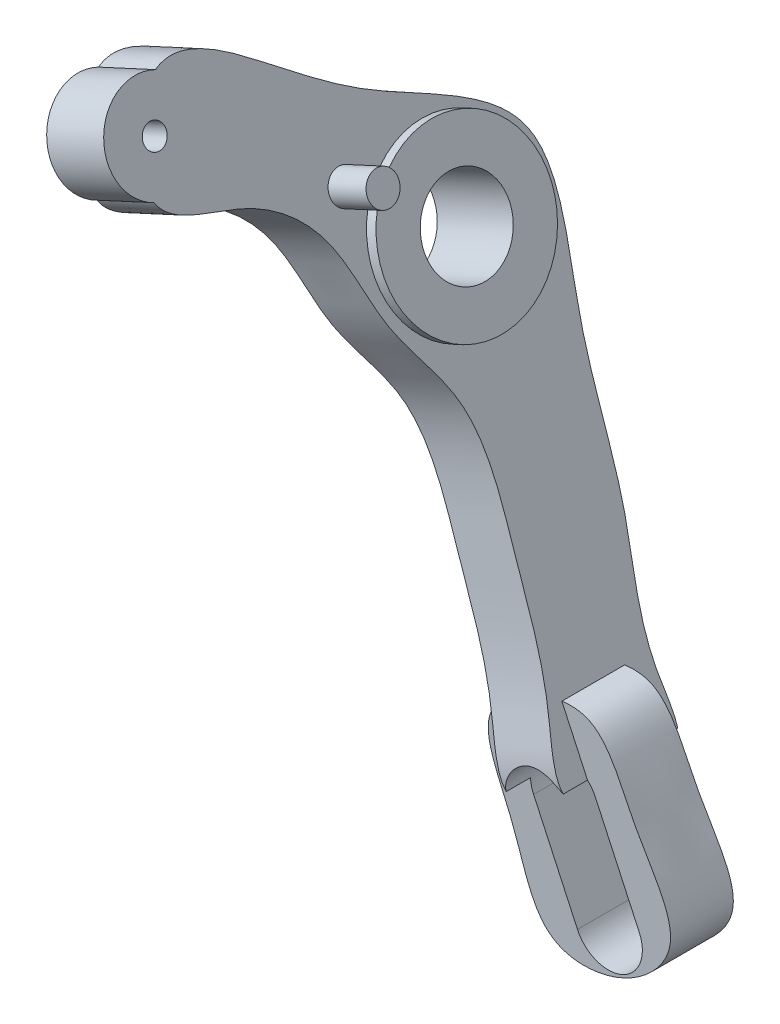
ISO-10303-21;
HEADER;
FILE_DESCRIPTION(('STEP AP214'),'2;1');
FILE_NAME('part.step','',(''),(''),'','','');
FILE_SCHEMA(('AUTOMOTIVE_DESIGN { 1 0 10303 214 1 1 1 1 }'));
ENDSEC;
DATA;
#1=APPLICATION_CONTEXT('core data for automotive mechanical design processes');
#2=APPLICATION_PROTOCOL_DEFINITION('international standard','automotive_design',2000,#1);
#3=PRODUCT_CONTEXT('',#1,'mechanical');
#4=PRODUCT('Part','Part','',(#3));
#5=PRODUCT_RELATED_PRODUCT_CATEGORY('part','',(#4));
#6=PRODUCT_DEFINITION_FORMATION('','',#4);
#7=PRODUCT_DEFINITION_CONTEXT('part definition',#1,'design');
#8=PRODUCT_DEFINITION('design','',#6,#7);
#9=PRODUCT_DEFINITION_SHAPE('','',#8);
#10=(LENGTH_UNIT() NAMED_UNIT(*) SI_UNIT(.MILLI.,.METRE.));
#11=(NAMED_UNIT(*) PLANE_ANGLE_UNIT() SI_UNIT($,.RADIAN.));
#12=(NAMED_UNIT(*) SI_UNIT($,.STERADIAN.) SOLID_ANGLE_UNIT());
#13=UNCERTAINTY_MEASURE_WITH_UNIT(LENGTH_MEASURE(1.E-05),#10,'distance_accuracy_value','');
#14=(GEOMETRIC_REPRESENTATION_CONTEXT(3) GLOBAL_UNCERTAINTY_ASSIGNED_CONTEXT((#13)) GLOBAL_UNIT_ASSIGNED_CONTEXT((#10,
#11,#12)) REPRESENTATION_CONTEXT('',''));
#15=CARTESIAN_POINT('',(0.,0.,0.));
#16=DIRECTION('',(0.,0.,1.));
#17=DIRECTION('',(1.,0.,0.));
#18=AXIS2_PLACEMENT_3D('',#15,#16,#17);
#19=CARTESIAN_POINT('',(430.319695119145,396.95551146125,-2.19631524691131));
#20=CARTESIAN_POINT('',(431.22681605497,394.990082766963,-3.15876795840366));
#21=CARTESIAN_POINT('',(431.517097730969,394.361139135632,-10.0566333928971));
#22=CARTESIAN_POINT('',(433.867436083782,389.268739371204,-16.0302949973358));
#23=CARTESIAN_POINT('',(437.242700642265,381.955666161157,-17.2201584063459));
#24=CARTESIAN_POINT('',(440.412269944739,375.088266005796,-23.2873268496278));
#25=CARTESIAN_POINT('',(445.123729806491,364.880102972,-21.8534182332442));
#26=CARTESIAN_POINT('',(448.883192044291,356.734601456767,-21.5246217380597));
#27=CARTESIAN_POINT('',(453.24164815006,347.291279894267,-17.578999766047));
#28=CARTESIAN_POINT('',(453.755843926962,346.177189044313,-31.9172258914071));
#29=CARTESIAN_POINT('',(449.228371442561,355.986712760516,-29.6405225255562));
#30=CARTESIAN_POINT('',(445.242127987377,364.623573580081,-32.7660924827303));
#31=CARTESIAN_POINT('',(439.926896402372,376.139908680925,-32.6259652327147));
#32=CARTESIAN_POINT('',(433.205878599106,390.702113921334,-37.7907879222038));
#33=CARTESIAN_POINT('',(431.054469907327,395.36349942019,-22.8994543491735));
#34=CARTESIAN_POINT('',(428.478191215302,400.945436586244,-15.3559389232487));
#35=CARTESIAN_POINT('',(425.343811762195,407.736592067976,-5.34947256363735));
#36=CARTESIAN_POINT('',(429.312632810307,399.137479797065,-1.12782502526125));
#37=CARTESIAN_POINT('',(430.319695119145,396.95551146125,-2.19631524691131));
#38=B_SPLINE_CURVE_WITH_KNOTS('',3,(#19,#20,#21,#22,#23,#24,#25,#26,#27,#28,#29,#30,#31,#32,#33,
#34,#35,#36,#37),.UNSPECIFIED.,.T.,.F.,(4,1,1,1,1,1,1,1,1,1,1,1,1,1,1,1,4),(0.,
0.0512804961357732,0.100877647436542,0.149980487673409,0.199406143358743,0.277465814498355,
0.346617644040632,0.385776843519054,0.449032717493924,0.48604368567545,0.557342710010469,
0.644342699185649,0.733550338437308,0.820503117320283,0.883725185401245,0.943069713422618,1.),.UNSPECIFIED.);
#39=DIRECTION('',(0.907959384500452,0.419058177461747,0.));
#40=VECTOR('',#39,1.);
#41=SURFACE_OF_LINEAR_EXTRUSION('',#38,#40);
#42=CARTESIAN_POINT('',(435.767451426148,399.46986052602,-2.19631524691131));
#43=CARTESIAN_POINT('',(436.674572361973,397.504431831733,-3.15876795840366));
#44=CARTESIAN_POINT('',(436.964854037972,396.875488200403,-10.0566333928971));
#45=CARTESIAN_POINT('',(439.315192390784,391.783088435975,-16.0302949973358));
#46=CARTESIAN_POINT('',(442.690456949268,384.470015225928,-17.2201584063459));
#47=CARTESIAN_POINT('',(445.860026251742,377.602615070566,-23.2873268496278));
#48=CARTESIAN_POINT('',(450.571486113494,367.39445203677,-21.8534182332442));
#49=CARTESIAN_POINT('',(454.330948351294,359.248950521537,-21.5246217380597));
#50=CARTESIAN_POINT('',(458.689404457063,349.805628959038,-17.578999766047));
#51=CARTESIAN_POINT('',(459.203600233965,348.691538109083,-31.9172258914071));
#52=CARTESIAN_POINT('',(454.676127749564,358.501061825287,-29.6405225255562));
#53=CARTESIAN_POINT('',(450.68988429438,367.137922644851,-32.7660924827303));
#54=CARTESIAN_POINT('',(445.374652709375,378.654257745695,-32.6259652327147));
#55=CARTESIAN_POINT('',(438.653634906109,393.216462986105,-37.7907879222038));
#56=CARTESIAN_POINT('',(436.502226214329,397.877848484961,-22.8994543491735));
#57=CARTESIAN_POINT('',(433.925947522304,403.459785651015,-15.3559389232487));
#58=CARTESIAN_POINT('',(430.791568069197,410.250941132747,-5.34947256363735));
#59=CARTESIAN_POINT('',(434.76038911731,401.651828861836,-1.12782502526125));
#60=CARTESIAN_POINT('',(435.767451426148,399.46986052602,-2.19631524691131));
#61=B_SPLINE_CURVE_WITH_KNOTS('',3,(#42,#43,#44,#45,#46,#47,#48,#49,#50,#51,#52,#53,#54,#55,#56,
#57,#58,#59,#60),.UNSPECIFIED.,.T.,.F.,(4,1,1,1,1,1,1,1,1,1,1,1,1,1,1,1,4),(0.,
0.0512804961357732,0.100877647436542,0.149980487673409,0.199406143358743,0.277465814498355,
0.346617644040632,0.385776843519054,0.449032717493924,0.48604368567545,0.557342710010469,
0.644342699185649,0.733550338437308,0.820503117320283,0.883725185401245,0.943069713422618,1.),.UNSPECIFIED.);
#62=CARTESIAN_POINT('',(435.767451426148,399.46986052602,-2.19631524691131));
#63=VERTEX_POINT('',#62);
#64=CARTESIAN_POINT('',(457.402290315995,352.594376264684,-19.6780583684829));
#65=VERTEX_POINT('',#64);
#66=EDGE_CURVE('E289',#63,#65,#61,.T.);
#67=ORIENTED_EDGE('',*,*,#66,.F.);
#68=DIRECTION('',(0.907959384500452,0.419058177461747,0.));
#69=VECTOR('',#68,1.);
#70=CARTESIAN_POINT('',(430.319695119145,396.95551146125,-2.19631524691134));
#71=LINE('',#70,#69);
#72=CARTESIAN_POINT('',(430.319695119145,396.95551146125,-2.19631524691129));
#73=VERTEX_POINT('',#72);
#74=EDGE_CURVE('E292',#73,#63,#71,.T.);
#75=ORIENTED_EDGE('',*,*,#74,.F.);
#76=CARTESIAN_POINT('',(451.954534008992,350.080027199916,-19.6780583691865));
#77=VERTEX_POINT('',#76);
#78=EDGE_CURVE('E297',#73,#77,#38,.T.);
#79=ORIENTED_EDGE('',*,*,#78,.T.);
#80=CARTESIAN_POINT('',(457.402290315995,352.594376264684,-19.6780583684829));
#81=CARTESIAN_POINT('',(457.342995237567,352.648947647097,-19.6605359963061));
#82=CARTESIAN_POINT('',(457.281210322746,352.701663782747,-19.6459470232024));
#83=CARTESIAN_POINT('',(457.153344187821,352.802686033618,-19.6217790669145));
#84=CARTESIAN_POINT('',(457.087268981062,352.850998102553,-19.6121932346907));
#85=CARTESIAN_POINT('',(456.951718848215,352.942410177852,-19.5971734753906));
#86=CARTESIAN_POINT('',(456.882264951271,352.985537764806,-19.5917166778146));
#87=CARTESIAN_POINT('',(456.740168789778,353.066507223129,-19.584046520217));
#88=CARTESIAN_POINT('',(456.66752547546,353.10434733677,-19.581834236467));
#89=CARTESIAN_POINT('',(456.446304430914,353.209123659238,-19.5789311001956));
#90=CARTESIAN_POINT('',(456.293680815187,353.267824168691,-19.5819087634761));
#91=CARTESIAN_POINT('',(455.981432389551,353.361686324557,-19.5927946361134));
#92=CARTESIAN_POINT('',(455.821797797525,353.396813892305,-19.600709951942));
#93=CARTESIAN_POINT('',(455.484118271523,353.444897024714,-19.6186692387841));
#94=CARTESIAN_POINT('',(455.305739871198,353.455491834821,-19.6288425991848));
#95=CARTESIAN_POINT('',(454.949499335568,353.447299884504,-19.6474770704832));
#96=CARTESIAN_POINT('',(454.771637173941,353.428514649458,-19.6559382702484));
#97=CARTESIAN_POINT('',(454.50673804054,353.378284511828,-19.6659034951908));
#98=CARTESIAN_POINT('',(454.417619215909,353.357447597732,-19.6687894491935));
#99=CARTESIAN_POINT('',(454.2414365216,353.308329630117,-19.6734229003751));
#100=CARTESIAN_POINT('',(454.154371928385,353.280051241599,-19.6751708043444));
#101=CARTESIAN_POINT('',(453.982900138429,353.216236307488,-19.6774277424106));
#102=CARTESIAN_POINT('',(453.898493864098,353.180697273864,-19.6779363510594));
#103=CARTESIAN_POINT('',(453.733012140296,353.102640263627,-19.6776871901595));
#104=CARTESIAN_POINT('',(453.651935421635,353.060124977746,-19.6769299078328));
#105=CARTESIAN_POINT('',(453.494637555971,352.968978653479,-19.6742076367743));
#106=CARTESIAN_POINT('',(453.418369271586,352.920428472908,-19.6722574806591));
#107=CARTESIAN_POINT('',(453.270191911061,352.817182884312,-19.6672700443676));
#108=CARTESIAN_POINT('',(453.198281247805,352.762489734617,-19.6642331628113));
#109=CARTESIAN_POINT('',(453.0592681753,352.647317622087,-19.6572454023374));
#110=CARTESIAN_POINT('',(452.992167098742,352.586837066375,-19.6532942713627));
#111=CARTESIAN_POINT('',(452.863274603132,352.460548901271,-19.6447252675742));
#112=CARTESIAN_POINT('',(452.801481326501,352.394743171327,-19.640107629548));
#113=CARTESIAN_POINT('',(452.683255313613,352.257846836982,-19.6304973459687));
#114=CARTESIAN_POINT('',(452.626855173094,352.186728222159,-19.6255027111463));
#115=CARTESIAN_POINT('',(452.520216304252,352.040048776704,-19.615572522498));
#116=CARTESIAN_POINT('',(452.469975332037,351.964489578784,-19.6106369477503));
#117=CARTESIAN_POINT('',(452.375896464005,351.809286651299,-19.6013161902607));
#118=CARTESIAN_POINT('',(452.332068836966,351.729636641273,-19.5969318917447));
#119=CARTESIAN_POINT('',(452.251235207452,351.566931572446,-19.5893312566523));
#120=CARTESIAN_POINT('',(452.214226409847,351.483877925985,-19.5861144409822));
#121=CARTESIAN_POINT('',(452.147008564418,351.314225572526,-19.5815502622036));
#122=CARTESIAN_POINT('',(452.116857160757,351.227603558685,-19.5802182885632));
#123=CARTESIAN_POINT('',(452.063974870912,351.052090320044,-19.5803460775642));
#124=CARTESIAN_POINT('',(452.041245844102,350.963198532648,-19.5818065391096));
#125=CARTESIAN_POINT('',(452.003471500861,350.784269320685,-19.5885188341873));
#126=CARTESIAN_POINT('',(451.988398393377,350.694237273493,-19.5937567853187));
#127=CARTESIAN_POINT('',(451.965914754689,350.513685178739,-19.609129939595));
#128=CARTESIAN_POINT('',(451.958496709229,350.423165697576,-19.6192603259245));
#129=CARTESIAN_POINT('',(451.953157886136,350.290582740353,-19.638610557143));
#130=CARTESIAN_POINT('',(451.952287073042,350.248270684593,-19.6454660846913));
#131=CARTESIAN_POINT('',(451.952187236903,350.163917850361,-19.6606369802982));
#132=CARTESIAN_POINT('',(451.952957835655,350.121877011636,-19.6689520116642));
#133=CARTESIAN_POINT('',(451.954534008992,350.080027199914,-19.6780583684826));
#134=B_SPLINE_CURVE_WITH_KNOTS('',3,(#80,#81,#82,#83,#84,#85,#86,#87,#88,#89,#90,#91,#92,#93,
#94,#95,#96,#97,#98,#99,#100,#101,#102,#103,#104,#105,#106,#107,#108,#109,#110,#111,#112,#113,
#114,#115,#116,#117,#118,#119,#120,#121,#122,#123,#124,#125,#126,#127,#128,#129,#130,#131,#132,
#133),.UNSPECIFIED.,.F.,.F.,(4,2,2,2,2,2,2,2,2,2,2,2,2,2,2,2,2,2,2,2,2,2,2,2,2,2,4),(0.,
0.2472072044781,0.49407510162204,0.739565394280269,0.985137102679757,1.47357669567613,
1.96272089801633,2.49726926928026,3.0317898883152,3.30621563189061,3.58054322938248,
3.85496498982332,4.12928115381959,4.40025381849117,4.67112718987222,4.94207532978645,
5.21292825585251,5.48532651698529,5.75762524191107,6.03035529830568,6.30297330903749,
6.57780461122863,6.85270470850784,7.12659965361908,7.40022548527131,7.52879402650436,
7.65733294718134),.UNSPECIFIED.);
#135=EDGE_CURVE('E185',#65,#77,#134,.T.);
#136=ORIENTED_EDGE('',*,*,#135,.F.);
#137=EDGE_LOOP('',(#67,#75,#79,#136));
#138=FACE_BOUND('',#137,.T.);
#139=ADVANCED_FACE('F67',(#138),#41,.T.);
#140=CARTESIAN_POINT('',(451.954534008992,350.080027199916,-30.625687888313));
#141=VERTEX_POINT('',#140);
#142=CARTESIAN_POINT('',(426.864386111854,404.44201431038,-5.80368475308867));
#143=VERTEX_POINT('',#142);
#144=EDGE_CURVE('E293',#141,#143,#38,.T.);
#145=ORIENTED_EDGE('',*,*,#144,.T.);
#146=DIRECTION('',(0.907959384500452,0.419058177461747,0.));
#147=VECTOR('',#146,1.);
#148=CARTESIAN_POINT('',(426.864386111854,404.44201431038,-5.80368475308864));
#149=LINE('',#148,#147);
#150=CARTESIAN_POINT('',(432.312142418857,406.95636337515,-5.80368475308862));
#151=VERTEX_POINT('',#150);
#152=EDGE_CURVE('E359',#151,#143,#149,.F.);
#153=ORIENTED_EDGE('',*,*,#152,.F.);
#154=CARTESIAN_POINT('',(457.402290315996,352.594376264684,-30.6256878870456));
#155=VERTEX_POINT('',#154);
#156=EDGE_CURVE('E294',#155,#151,#61,.T.);
#157=ORIENTED_EDGE('',*,*,#156,.F.);
#158=CARTESIAN_POINT('',(451.954534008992,350.080027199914,-30.6256878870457));
#159=CARTESIAN_POINT('',(451.951215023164,350.167768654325,-30.6362105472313));
#160=CARTESIAN_POINT('',(451.951477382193,350.25584929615,-30.6447610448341));
#161=CARTESIAN_POINT('',(451.959166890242,350.431905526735,-30.6586447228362));
#162=CARTESIAN_POINT('',(451.966589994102,350.51988114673,-30.6639797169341));
#163=CARTESIAN_POINT('',(451.988575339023,350.694853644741,-30.6721606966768));
#164=CARTESIAN_POINT('',(452.003121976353,350.781852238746,-30.6750120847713));
#165=CARTESIAN_POINT('',(452.039238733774,350.95440661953,-30.6788448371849));
#166=CARTESIAN_POINT('',(452.060809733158,351.039962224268,-30.6798259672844));
#167=CARTESIAN_POINT('',(452.135793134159,351.293281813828,-30.6807603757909));
#168=CARTESIAN_POINT('',(452.199529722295,351.458123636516,-30.6787190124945));
#169=CARTESIAN_POINT('',(452.352797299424,351.775237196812,-30.6724526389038));
#170=CARTESIAN_POINT('',(452.442336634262,351.927504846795,-30.6682269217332));
#171=CARTESIAN_POINT('',(452.648254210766,352.220357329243,-30.6594904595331));
#172=CARTESIAN_POINT('',(452.765423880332,352.360387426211,-30.6549749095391));
#173=CARTESIAN_POINT('',(453.021547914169,352.618908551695,-30.6471625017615));
#174=CARTESIAN_POINT('',(453.160504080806,352.737397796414,-30.6438657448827));
#175=CARTESIAN_POINT('',(453.456874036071,352.949903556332,-30.6391942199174));
#176=CARTESIAN_POINT('',(453.614357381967,353.043823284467,-30.6378269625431));
#177=CARTESIAN_POINT('',(453.942856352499,353.203894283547,-30.6372873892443));
#178=CARTESIAN_POINT('',(454.11387198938,353.27004552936,-30.6381150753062));
#179=CARTESIAN_POINT('',(454.464192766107,353.37258779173,-30.6418147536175));
#180=CARTESIAN_POINT('',(454.643479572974,353.409041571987,-30.6446824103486));
#181=CARTESIAN_POINT('',(455.005560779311,353.451416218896,-30.651867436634));
#182=CARTESIAN_POINT('',(455.188355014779,353.45733850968,-30.65618473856));
#183=CARTESIAN_POINT('',(455.552764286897,353.438442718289,-30.6651009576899));
#184=CARTESIAN_POINT('',(455.734376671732,353.413570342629,-30.6697003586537));
#185=CARTESIAN_POINT('',(456.001592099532,353.353744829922,-30.6752390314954));
#186=CARTESIAN_POINT('',(456.08983974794,353.33003258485,-30.676858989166));
#187=CARTESIAN_POINT('',(456.264028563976,353.275266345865,-30.6792698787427));
#188=CARTESIAN_POINT('',(456.349970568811,353.244215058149,-30.6800611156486));
#189=CARTESIAN_POINT('',(456.52337446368,353.173165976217,-30.6803826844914));
#190=CARTESIAN_POINT('',(456.610679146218,353.132783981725,-30.6798446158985));
#191=CARTESIAN_POINT('',(456.781335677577,353.044465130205,-30.6767287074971));
#192=CARTESIAN_POINT('',(456.864687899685,352.996528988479,-30.6741510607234));
#193=CARTESIAN_POINT('',(457.026953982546,352.893377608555,-30.6661935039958));
#194=CARTESIAN_POINT('',(457.105855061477,352.838142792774,-30.6608059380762));
#195=CARTESIAN_POINT('',(457.258294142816,352.721062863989,-30.6462888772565));
#196=CARTESIAN_POINT('',(457.331828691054,352.659213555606,-30.6371569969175));
#197=CARTESIAN_POINT('',(457.402290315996,352.594376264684,-30.6256878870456));
#198=B_SPLINE_CURVE_WITH_KNOTS('',3,(#158,#159,#160,#161,#162,#163,#164,#165,#166,#167,#168,
#169,#170,#171,#172,#173,#174,#175,#176,#177,#178,#179,#180,#181,#182,#183,#184,#185,#186,#187,
#188,#189,#190,#191,#192,#193,#194,#195,#196,#197),.UNSPECIFIED.,.F.,.F.,(4,2,2,2,2,2,2,2,2,2,2,
2,2,2,2,2,2,2,2,4),(0.,0.265155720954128,0.530161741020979,0.794589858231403,1.05905108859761,
1.58670323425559,2.11452623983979,2.6598494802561,3.20521785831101,3.75270331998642,
4.30018927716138,4.84651513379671,5.39281550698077,5.94008042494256,6.21398827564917,
6.48779528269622,6.77598167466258,7.06414079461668,7.35308917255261,7.64222192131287),.UNSPECIFIED.);
#199=EDGE_CURVE('E207',#141,#155,#198,.T.);
#200=ORIENTED_EDGE('',*,*,#199,.F.);
#201=EDGE_LOOP('',(#145,#153,#157,#200));
#202=FACE_BOUND('',#201,.T.);
#203=ADVANCED_FACE('F69',(#202),#41,.T.);
#204=CARTESIAN_POINT('',(449.219383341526,356.006186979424,-30.4725989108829));
#205=DIRECTION('',(0.907959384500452,0.419058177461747,0.));
#206=DIRECTION('',(-0.419058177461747,0.907959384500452,0.));
#207=AXIS2_PLACEMENT_3D('',#204,#205,#206);
#208=PLANE('',#207);
#209=CARTESIAN_POINT('',(428.5920406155,400.698762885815,-4.));
#210=DIRECTION('',(-0.907959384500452,-0.419058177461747,0.));
#211=DIRECTION('',(-0.419058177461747,0.907959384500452,0.));
#212=AXIS2_PLACEMENT_3D('',#209,#210,#211);
#213=CIRCLE('',#212,1.1);
#214=CARTESIAN_POINT('',(428.131076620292,401.697518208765,-4.));
#215=VERTEX_POINT('',#214);
#216=EDGE_CURVE('E215',#215,#215,#213,.T.);
#217=ORIENTED_EDGE('',*,*,#216,.F.);
#218=EDGE_LOOP('',(#217));
#219=FACE_BOUND('',#218,.T.);
#220=CARTESIAN_POINT('',(435.506500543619,385.717433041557,-26.));
#221=DIRECTION('',(-0.907959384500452,-0.419058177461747,0.));
#222=DIRECTION('',(-0.419058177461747,0.907959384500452,0.));
#223=AXIS2_PLACEMENT_3D('',#220,#221,#222);
#224=CIRCLE('',#223,8.);
#225=CARTESIAN_POINT('',(432.154035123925,392.981108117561,-26.));
#226=VERTEX_POINT('',#225);
#227=EDGE_CURVE('E299',#226,#226,#224,.T.);
#228=ORIENTED_EDGE('',*,*,#227,.F.);
#229=EDGE_LOOP('',(#228));
#230=FACE_BOUND('',#229,.T.);
#231=ORIENTED_EDGE('',*,*,#78,.F.);
#232=CARTESIAN_POINT('',(428.5920406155,400.698762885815,-4.));
#233=DIRECTION('',(-0.907959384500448,-0.419058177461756,0.));
#234=DIRECTION('',(-0.419058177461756,0.907959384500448,0.));
#235=AXIS2_PLACEMENT_3D('',#232,#233,#234);
#236=CIRCLE('',#235,4.5);
#237=EDGE_CURVE('E361',#73,#143,#236,.T.);
#238=ORIENTED_EDGE('',*,*,#237,.T.);
#239=ORIENTED_EDGE('',*,*,#144,.F.);
#240=DIRECTION('',(0.,0.,-1.));
#241=VECTOR('',#240,1.);
#242=CARTESIAN_POINT('',(451.954534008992,350.080027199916,0.500000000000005));
#243=LINE('',#242,#241);
#244=CARTESIAN_POINT('',(451.954534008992,350.080027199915,-28.));
#245=VERTEX_POINT('',#244);
#246=EDGE_CURVE('E186',#245,#141,#243,.T.);
#247=ORIENTED_EDGE('',*,*,#246,.F.);
#248=DIRECTION('',(0.419058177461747,-0.907959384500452,0.));
#249=VECTOR('',#248,1.);
#250=CARTESIAN_POINT('',(449.219383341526,356.006186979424,-28.));
#251=LINE('',#250,#249);
#252=CARTESIAN_POINT('',(449.503668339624,355.390236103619,-28.));
#253=VERTEX_POINT('',#252);
#254=EDGE_CURVE('E351',#253,#245,#251,.T.);
#255=ORIENTED_EDGE('',*,*,#254,.F.);
#256=DIRECTION('',(0.,0.,1.));
#257=VECTOR('',#256,1.);
#258=CARTESIAN_POINT('',(449.50366835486,355.390236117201,-28.));
#259=LINE('',#258,#257);
#260=CARTESIAN_POINT('',(449.503668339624,355.390236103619,-22.));
#261=VERTEX_POINT('',#260);
#262=EDGE_CURVE('E349',#253,#261,#259,.T.);
#263=ORIENTED_EDGE('',*,*,#262,.T.);
#264=DIRECTION('',(0.419058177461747,-0.907959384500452,0.));
#265=VECTOR('',#264,1.);
#266=CARTESIAN_POINT('',(449.219383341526,356.006186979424,-22.));
#267=LINE('',#266,#265);
#268=CARTESIAN_POINT('',(451.954534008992,350.080027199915,-22.));
#269=VERTEX_POINT('',#268);
#270=EDGE_CURVE('E229',#261,#269,#267,.T.);
#271=ORIENTED_EDGE('',*,*,#270,.T.);
#272=EDGE_CURVE('E182',#77,#269,#243,.T.);
#273=ORIENTED_EDGE('',*,*,#272,.F.);
#274=EDGE_LOOP('',(#231,#238,#239,#247,#255,#263,#271,#273));
#275=FACE_BOUND('',#274,.T.);
#276=ADVANCED_FACE('F270',(#219,#230,#275),#208,.F.);
#277=CARTESIAN_POINT('',(454.667139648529,358.520536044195,-30.4725989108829));
#278=DIRECTION('',(0.907959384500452,0.419058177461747,0.));
#279=DIRECTION('',(-0.419058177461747,0.907959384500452,0.));
#280=AXIS2_PLACEMENT_3D('',#277,#278,#279);
#281=PLANE('',#280);
#282=DIRECTION('',(0.,0.,-1.));
#283=VECTOR('',#282,1.);
#284=CARTESIAN_POINT('',(457.402290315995,352.594376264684,0.499999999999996));
#285=LINE('',#284,#283);
#286=CARTESIAN_POINT('',(457.402290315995,352.594376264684,-21.999999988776));
#287=VERTEX_POINT('',#286);
#288=EDGE_CURVE('E194',#65,#287,#285,.T.);
#289=ORIENTED_EDGE('',*,*,#288,.T.);
#290=DIRECTION('',(0.419058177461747,-0.907959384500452,0.));
#291=VECTOR('',#290,1.);
#292=CARTESIAN_POINT('',(454.667139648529,358.520536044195,-22.));
#293=LINE('',#292,#291);
#294=CARTESIAN_POINT('',(454.951424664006,357.904585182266,-22.));
#295=VERTEX_POINT('',#294);
#296=EDGE_CURVE('E316',#295,#287,#293,.T.);
#297=ORIENTED_EDGE('',*,*,#296,.F.);
#298=DIRECTION('',(0.,0.,1.));
#299=VECTOR('',#298,1.);
#300=CARTESIAN_POINT('',(454.951424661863,357.904585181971,-28.));
#301=LINE('',#300,#299);
#302=CARTESIAN_POINT('',(454.951424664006,357.904585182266,-28.));
#303=VERTEX_POINT('',#302);
#304=EDGE_CURVE('E319',#303,#295,#301,.T.);
#305=ORIENTED_EDGE('',*,*,#304,.F.);
#306=DIRECTION('',(0.419058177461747,-0.907959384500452,0.));
#307=VECTOR('',#306,1.);
#308=CARTESIAN_POINT('',(454.667139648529,358.520536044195,-28.));
#309=LINE('',#308,#307);
#310=CARTESIAN_POINT('',(457.402290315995,352.594376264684,-28.000000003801));
#311=VERTEX_POINT('',#310);
#312=EDGE_CURVE('E322',#303,#311,#309,.T.);
#313=ORIENTED_EDGE('',*,*,#312,.T.);
#314=EDGE_CURVE('E214',#311,#155,#285,.T.);
#315=ORIENTED_EDGE('',*,*,#314,.T.);
#316=ORIENTED_EDGE('',*,*,#156,.T.);
#317=CARTESIAN_POINT('',(434.039796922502,403.213111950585,-4.));
#318=DIRECTION('',(-0.907959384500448,-0.419058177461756,0.));
#319=DIRECTION('',(-0.419058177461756,0.907959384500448,0.));
#320=AXIS2_PLACEMENT_3D('',#317,#318,#319);
#321=CIRCLE('',#320,4.5);
#322=EDGE_CURVE('E360',#63,#151,#321,.T.);
#323=ORIENTED_EDGE('',*,*,#322,.F.);
#324=ORIENTED_EDGE('',*,*,#66,.T.);
#325=EDGE_LOOP('',(#289,#297,#305,#313,#315,#316,#323,#324));
#326=FACE_BOUND('',#325,.T.);
#327=CARTESIAN_POINT('',(434.039796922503,403.213111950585,-4.));
#328=DIRECTION('',(-0.907959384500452,-0.419058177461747,0.));
#329=DIRECTION('',(-0.419058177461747,0.907959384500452,0.));
#330=AXIS2_PLACEMENT_3D('',#327,#328,#329);
#331=CIRCLE('',#330,1.1);
#332=CARTESIAN_POINT('',(433.578832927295,404.211867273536,-4.));
#333=VERTEX_POINT('',#332);
#334=EDGE_CURVE('E219',#333,#333,#331,.T.);
#335=ORIENTED_EDGE('',*,*,#334,.T.);
#336=EDGE_LOOP('',(#335));
#337=FACE_BOUND('',#336,.T.);
#338=CARTESIAN_POINT('',(438.23037869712,394.133518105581,-18.));
#339=DIRECTION('',(-0.907959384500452,-0.419058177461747,0.));
#340=DIRECTION('',(-0.419058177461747,0.907959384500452,0.));
#341=AXIS2_PLACEMENT_3D('',#338,#339,#340);
#342=CIRCLE('',#341,1.5);
#343=CARTESIAN_POINT('',(437.601791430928,395.495457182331,-18.));
#344=VERTEX_POINT('',#343);
#345=EDGE_CURVE('E313',#344,#344,#342,.T.);
#346=ORIENTED_EDGE('',*,*,#345,.T.);
#347=EDGE_LOOP('',(#346));
#348=FACE_BOUND('',#347,.T.);
#349=CARTESIAN_POINT('',(440.954256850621,388.231782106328,-26.));
#350=DIRECTION('',(-0.907959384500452,-0.419058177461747,0.));
#351=DIRECTION('',(-0.419058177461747,0.907959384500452,0.));
#352=AXIS2_PLACEMENT_3D('',#349,#350,#351);
#353=CIRCLE('',#352,8.);
#354=CARTESIAN_POINT('',(437.601791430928,395.495457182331,-26.));
#355=VERTEX_POINT('',#354);
#356=EDGE_CURVE('E307',#355,#355,#353,.T.);
#357=ORIENTED_EDGE('',*,*,#356,.T.);
#358=EDGE_LOOP('',(#357));
#359=FACE_BOUND('',#358,.T.);
#360=ADVANCED_FACE('F265',(#326,#337,#348,#359),#281,.T.);
#361=CARTESIAN_POINT('',(441.862216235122,388.650840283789,-26.));
#362=DIRECTION('',(0.907959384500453,0.419058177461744,0.));
#363=DIRECTION('',(-0.419058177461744,0.907959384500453,0.));
#364=AXIS2_PLACEMENT_3D('',#361,#362,#363);
#365=PLANE('',#364);
#366=CARTESIAN_POINT('',(441.862216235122,388.650840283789,-26.));
#367=DIRECTION('',(-0.907959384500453,-0.419058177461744,0.));
#368=DIRECTION('',(-0.419058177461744,0.907959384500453,0.));
#369=AXIS2_PLACEMENT_3D('',#366,#367,#368);
#370=CIRCLE('',#369,4.1);
#371=CARTESIAN_POINT('',(440.144077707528,392.373473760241,-26.));
#372=VERTEX_POINT('',#371);
#373=EDGE_CURVE('E220',#372,#372,#370,.T.);
#374=ORIENTED_EDGE('',*,*,#373,.T.);
#375=EDGE_LOOP('',(#374));
#376=FACE_BOUND('',#375,.T.);
#377=CARTESIAN_POINT('',(441.862216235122,388.650840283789,-26.));
#378=DIRECTION('',(-0.907959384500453,-0.419058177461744,0.));
#379=DIRECTION('',(-0.419058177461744,0.907959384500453,0.));
#380=AXIS2_PLACEMENT_3D('',#377,#378,#379);
#381=CIRCLE('',#380,8.);
#382=CARTESIAN_POINT('',(438.509750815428,395.914515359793,-26.));
#383=VERTEX_POINT('',#382);
#384=EDGE_CURVE('E370',#383,#383,#381,.T.);
#385=ORIENTED_EDGE('',*,*,#384,.F.);
#386=EDGE_LOOP('',(#385));
#387=FACE_BOUND('',#386,.T.);
#388=ADVANCED_FACE('F261',(#376,#387),#365,.T.);
#389=CARTESIAN_POINT('',(434.598541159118,385.298374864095,-26.));
#390=DIRECTION('',(0.907959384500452,0.419058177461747,0.));
#391=DIRECTION('',(-0.419058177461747,0.907959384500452,0.));
#392=AXIS2_PLACEMENT_3D('',#389,#390,#391);
#393=CYLINDRICAL_SURFACE('',#392,8.);
#394=ORIENTED_EDGE('',*,*,#356,.F.);
#395=EDGE_LOOP('',(#394));
#396=FACE_BOUND('',#395,.T.);
#397=ORIENTED_EDGE('',*,*,#384,.T.);
#398=EDGE_LOOP('',(#397));
#399=FACE_BOUND('',#398,.T.);
#400=ADVANCED_FACE('F257',(#396,#399),#393,.T.);
#401=CARTESIAN_POINT('',(434.598541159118,385.298374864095,-26.));
#402=DIRECTION('',(-0.907959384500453,-0.419058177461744,0.));
#403=DIRECTION('',(-0.419058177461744,0.907959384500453,0.));
#404=AXIS2_PLACEMENT_3D('',#401,#402,#403);
#405=CIRCLE('',#404,8.);
#406=CARTESIAN_POINT('',(431.246075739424,392.562049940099,-26.));
#407=VERTEX_POINT('',#406);
#408=EDGE_CURVE('E364',#407,#407,#405,.T.);
#409=ORIENTED_EDGE('',*,*,#408,.F.);
#410=EDGE_LOOP('',(#409));
#411=FACE_BOUND('',#410,.T.);
#412=ORIENTED_EDGE('',*,*,#227,.T.);
#413=EDGE_LOOP('',(#412));
#414=FACE_BOUND('',#413,.T.);
#415=ADVANCED_FACE('F260',(#411,#414),#393,.T.);
#416=CARTESIAN_POINT('',(434.598541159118,385.298374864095,-26.));
#417=DIRECTION('',(0.907959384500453,0.419058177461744,0.));
#418=DIRECTION('',(-0.419058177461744,0.907959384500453,0.));
#419=AXIS2_PLACEMENT_3D('',#416,#417,#418);
#420=PLANE('',#419);
#421=CARTESIAN_POINT('',(434.598541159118,385.298374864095,-26.));
#422=DIRECTION('',(-0.907959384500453,-0.419058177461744,0.));
#423=DIRECTION('',(-0.419058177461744,0.907959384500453,0.));
#424=AXIS2_PLACEMENT_3D('',#421,#422,#423);
#425=CIRCLE('',#424,4.1);
#426=CARTESIAN_POINT('',(432.880402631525,389.021008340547,-26.));
#427=VERTEX_POINT('',#426);
#428=EDGE_CURVE('E218',#427,#427,#425,.T.);
#429=ORIENTED_EDGE('',*,*,#428,.F.);
#430=EDGE_LOOP('',(#429));
#431=FACE_BOUND('',#430,.T.);
#432=ORIENTED_EDGE('',*,*,#408,.T.);
#433=EDGE_LOOP('',(#432));
#434=FACE_BOUND('',#433,.T.);
#435=ADVANCED_FACE('F255',(#431,#434),#420,.F.);
#436=CARTESIAN_POINT('',(428.5920406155,400.698762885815,-4.));
#437=DIRECTION('',(0.907959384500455,0.41905817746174,0.));
#438=DIRECTION('',(-0.41905817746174,0.907959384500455,0.));
#439=AXIS2_PLACEMENT_3D('',#436,#437,#438);
#440=CYLINDRICAL_SURFACE('',#439,4.5);
#441=ORIENTED_EDGE('',*,*,#152,.T.);
#442=ORIENTED_EDGE('',*,*,#237,.F.);
#443=ORIENTED_EDGE('',*,*,#74,.T.);
#444=ORIENTED_EDGE('',*,*,#322,.T.);
#445=EDGE_LOOP('',(#441,#442,#443,#444));
#446=FACE_BOUND('',#445,.T.);
#447=ADVANCED_FACE('F251',(#446),#440,.T.);
#448=CARTESIAN_POINT('',(441.862216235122,395.809750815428,-18.));
#449=DIRECTION('',(0.907959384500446,0.41905817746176,0.));
#450=DIRECTION('',(-0.41905817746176,0.907959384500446,0.));
#451=AXIS2_PLACEMENT_3D('',#448,#449,#450);
#452=PLANE('',#451);
#453=CARTESIAN_POINT('',(441.862216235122,395.809750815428,-18.));
#454=DIRECTION('',(-0.907959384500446,-0.41905817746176,0.));
#455=DIRECTION('',(-0.41905817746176,0.907959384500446,0.));
#456=AXIS2_PLACEMENT_3D('',#453,#454,#455);
#457=CIRCLE('',#456,1.5);
#458=CARTESIAN_POINT('',(441.233628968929,397.171689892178,-18.));
#459=VERTEX_POINT('',#458);
#460=EDGE_CURVE('E528',#459,#459,#457,.T.);
#461=ORIENTED_EDGE('',*,*,#460,.F.);
#462=EDGE_LOOP('',(#461));
#463=FACE_BOUND('',#462,.T.);
#464=ADVANCED_FACE('F247',(#463),#452,.T.);
#465=CARTESIAN_POINT('',(438.23037869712,394.133518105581,-18.));
#466=DIRECTION('',(0.90795938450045,0.41905817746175,0.));
#467=DIRECTION('',(-0.41905817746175,0.90795938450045,0.));
#468=AXIS2_PLACEMENT_3D('',#465,#466,#467);
#469=CYLINDRICAL_SURFACE('',#468,1.5);
#470=ORIENTED_EDGE('',*,*,#460,.T.);
#471=EDGE_LOOP('',(#470));
#472=FACE_BOUND('',#471,.T.);
#473=ORIENTED_EDGE('',*,*,#345,.F.);
#474=EDGE_LOOP('',(#473));
#475=FACE_BOUND('',#474,.T.);
#476=ADVANCED_FACE('F241',(#472,#475),#469,.T.);
#477=CARTESIAN_POINT('',(448.148088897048,353.554717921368,-28.));
#478=CARTESIAN_POINT('',(447.297042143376,351.329023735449,-28.));
#479=CARTESIAN_POINT('',(450.863948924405,345.531263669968,-28.));
#480=CARTESIAN_POINT('',(452.453990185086,336.529845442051,-28.));
#481=CARTESIAN_POINT('',(461.252405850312,337.093548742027,-28.));
#482=CARTESIAN_POINT('',(467.389610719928,343.423208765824,-28.));
#483=CARTESIAN_POINT('',(461.571338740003,350.473135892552,-28.));
#484=CARTESIAN_POINT('',(458.835109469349,358.919679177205,-28.));
#485=CARTESIAN_POINT('',(451.877982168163,357.404800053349,-28.));
#486=CARTESIAN_POINT('',(448.693901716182,354.982151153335,-28.));
#487=CARTESIAN_POINT('',(448.148088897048,353.554717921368,-28.));
#488=B_SPLINE_CURVE_WITH_KNOTS('',3,(#477,#478,#479,#480,#481,#482,#483,#484,#485,#486,#487),
.UNSPECIFIED.,.T.,.F.,(4,1,1,1,1,1,1,1,4),(0.,0.140949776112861,0.297042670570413,
0.409602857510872,0.52216304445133,0.678255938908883,0.819205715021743,0.909602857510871,1.),.UNSPECIFIED.);
#489=DIRECTION('',(0.,0.,1.));
#490=VECTOR('',#489,1.);
#491=SURFACE_OF_LINEAR_EXTRUSION('',#488,#490);
#492=EDGE_CURVE('E224',#253,#303,#488,.T.);
#493=ORIENTED_EDGE('',*,*,#492,.T.);
#494=ORIENTED_EDGE('',*,*,#304,.T.);
#495=CARTESIAN_POINT('',(448.148088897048,353.554717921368,-22.));
#496=CARTESIAN_POINT('',(447.297042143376,351.329023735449,-22.));
#497=CARTESIAN_POINT('',(450.863948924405,345.531263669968,-22.));
#498=CARTESIAN_POINT('',(452.453990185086,336.529845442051,-22.));
#499=CARTESIAN_POINT('',(461.252405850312,337.093548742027,-22.));
#500=CARTESIAN_POINT('',(467.389610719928,343.423208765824,-22.));
#501=CARTESIAN_POINT('',(461.571338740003,350.473135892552,-22.));
#502=CARTESIAN_POINT('',(458.835109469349,358.919679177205,-22.));
#503=CARTESIAN_POINT('',(451.877982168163,357.404800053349,-22.));
#504=CARTESIAN_POINT('',(448.693901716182,354.982151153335,-22.));
#505=CARTESIAN_POINT('',(448.148088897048,353.554717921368,-22.));
#506=B_SPLINE_CURVE_WITH_KNOTS('',3,(#495,#496,#497,#498,#499,#500,#501,#502,#503,#504,#505),
.UNSPECIFIED.,.T.,.F.,(4,1,1,1,1,1,1,1,4),(0.,0.140949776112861,0.297042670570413,
0.409602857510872,0.52216304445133,0.678255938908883,0.819205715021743,0.909602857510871,1.),.UNSPECIFIED.);
#507=EDGE_CURVE('E223',#261,#295,#506,.T.);
#508=ORIENTED_EDGE('',*,*,#507,.F.);
#509=ORIENTED_EDGE('',*,*,#262,.F.);
#510=EDGE_LOOP('',(#493,#494,#508,#509));
#511=FACE_BOUND('',#510,.T.);
#512=ADVANCED_FACE('F237',(#511),#491,.T.);
#513=CARTESIAN_POINT('',(464.875094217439,341.61774892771,-28.));
#514=DIRECTION('',(0.,0.,-1.));
#515=DIRECTION('',(1.,0.,0.));
#516=AXIS2_PLACEMENT_3D('',#513,#514,#515);
#517=PLANE('',#516);
#518=CARTESIAN_POINT('',(455.20223488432,350.202252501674,-28.));
#519=DIRECTION('',(0.,0.,1.));
#520=DIRECTION('',(1.,0.,0.));
#521=AXIS2_PLACEMENT_3D('',#518,#519,#520);
#522=CIRCLE('',#521,3.25000000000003);
#523=CARTESIAN_POINT('',(458.153102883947,351.564191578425,-28.));
#524=VERTEX_POINT('',#523);
#525=EDGE_CURVE('E329',#524,#311,#522,.T.);
#526=ORIENTED_EDGE('',*,*,#525,.T.);
#527=ORIENTED_EDGE('',*,*,#312,.F.);
#528=ORIENTED_EDGE('',*,*,#492,.F.);
#529=ORIENTED_EDGE('',*,*,#254,.T.);
#530=CARTESIAN_POINT('',(452.251366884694,348.840313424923,-28.));
#531=VERTEX_POINT('',#530);
#532=EDGE_CURVE('E175',#245,#531,#522,.T.);
#533=ORIENTED_EDGE('',*,*,#532,.T.);
#534=DIRECTION('',(0.419058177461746,-0.907959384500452,0.));
#535=VECTOR('',#534,1.);
#536=CARTESIAN_POINT('',(457.216314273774,338.08292741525,-28.));
#537=LINE('',#536,#535);
#538=CARTESIAN_POINT('',(456.441948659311,339.760719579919,-28.));
#539=VERTEX_POINT('',#538);
#540=EDGE_CURVE('E158',#531,#539,#537,.T.);
#541=ORIENTED_EDGE('',*,*,#540,.T.);
#542=CARTESIAN_POINT('',(459.392816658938,341.12265865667,-28.));
#543=DIRECTION('',(0.,0.,1.));
#544=DIRECTION('',(1.,0.,0.));
#545=AXIS2_PLACEMENT_3D('',#542,#543,#544);
#546=CIRCLE('',#545,3.24999999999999);
#547=CARTESIAN_POINT('',(462.343684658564,342.48459773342,-28.));
#548=VERTEX_POINT('',#547);
#549=EDGE_CURVE('E166',#539,#548,#546,.T.);
#550=ORIENTED_EDGE('',*,*,#549,.T.);
#551=DIRECTION('',(-0.419058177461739,0.907959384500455,0.));
#552=VECTOR('',#551,1.);
#553=CARTESIAN_POINT('',(463.118050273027,340.806805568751,-28.));
#554=LINE('',#553,#552);
#555=EDGE_CURVE('E171',#548,#524,#554,.T.);
#556=ORIENTED_EDGE('',*,*,#555,.T.);
#557=EDGE_LOOP('',(#526,#527,#528,#529,#533,#541,#550,#556));
#558=FACE_BOUND('',#557,.T.);
#559=ADVANCED_FACE('F173',(#558),#517,.T.);
#560=CARTESIAN_POINT('',(464.875094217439,341.61774892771,-22.));
#561=DIRECTION('',(0.,0.,-1.));
#562=DIRECTION('',(1.,0.,0.));
#563=AXIS2_PLACEMENT_3D('',#560,#561,#562);
#564=PLANE('',#563);
#565=DIRECTION('',(-0.419058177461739,0.907959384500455,0.));
#566=VECTOR('',#565,1.);
#567=CARTESIAN_POINT('',(463.118050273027,340.806805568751,-22.));
#568=LINE('',#567,#566);
#569=CARTESIAN_POINT('',(462.343684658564,342.48459773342,-22.));
#570=VERTEX_POINT('',#569);
#571=CARTESIAN_POINT('',(458.153102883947,351.564191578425,-22.));
#572=VERTEX_POINT('',#571);
#573=EDGE_CURVE('E332',#570,#572,#568,.T.);
#574=ORIENTED_EDGE('',*,*,#573,.F.);
#575=CARTESIAN_POINT('',(459.392816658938,341.12265865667,-22.));
#576=DIRECTION('',(0.,0.,1.));
#577=DIRECTION('',(1.,0.,0.));
#578=AXIS2_PLACEMENT_3D('',#575,#576,#577);
#579=CIRCLE('',#578,3.24999999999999);
#580=CARTESIAN_POINT('',(456.441948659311,339.760719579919,-22.));
#581=VERTEX_POINT('',#580);
#582=EDGE_CURVE('E331',#581,#570,#579,.T.);
#583=ORIENTED_EDGE('',*,*,#582,.F.);
#584=DIRECTION('',(0.419058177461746,-0.907959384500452,0.));
#585=VECTOR('',#584,1.);
#586=CARTESIAN_POINT('',(457.216314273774,338.08292741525,-22.));
#587=LINE('',#586,#585);
#588=CARTESIAN_POINT('',(452.251366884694,348.840313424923,-22.));
#589=VERTEX_POINT('',#588);
#590=EDGE_CURVE('E161',#589,#581,#587,.T.);
#591=ORIENTED_EDGE('',*,*,#590,.F.);
#592=CARTESIAN_POINT('',(455.20223488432,350.202252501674,-22.));
#593=DIRECTION('',(0.,0.,1.));
#594=DIRECTION('',(1.,0.,0.));
#595=AXIS2_PLACEMENT_3D('',#592,#593,#594);
#596=CIRCLE('',#595,3.25000000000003);
#597=EDGE_CURVE('E73',#269,#589,#596,.T.);
#598=ORIENTED_EDGE('',*,*,#597,.F.);
#599=ORIENTED_EDGE('',*,*,#270,.F.);
#600=ORIENTED_EDGE('',*,*,#507,.T.);
#601=ORIENTED_EDGE('',*,*,#296,.T.);
#602=EDGE_CURVE('E12',#572,#287,#596,.T.);
#603=ORIENTED_EDGE('',*,*,#602,.F.);
#604=EDGE_LOOP('',(#574,#583,#591,#598,#599,#600,#601,#603));
#605=FACE_BOUND('',#604,.T.);
#606=ADVANCED_FACE('F243',(#605),#564,.F.);
#607=CARTESIAN_POINT('',(433.690581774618,384.879316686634,-26.));
#608=DIRECTION('',(0.907959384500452,0.419058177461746,0.));
#609=DIRECTION('',(-0.419058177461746,0.907959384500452,0.));
#610=AXIS2_PLACEMENT_3D('',#607,#608,#609);
#611=CYLINDRICAL_SURFACE('',#610,4.1);
#612=ORIENTED_EDGE('',*,*,#373,.F.);
#613=EDGE_LOOP('',(#612));
#614=FACE_BOUND('',#613,.T.);
#615=ORIENTED_EDGE('',*,*,#428,.T.);
#616=EDGE_LOOP('',(#615));
#617=FACE_BOUND('',#616,.T.);
#618=ADVANCED_FACE('F415',(#614,#617),#611,.F.);
#619=CARTESIAN_POINT('',(426.776121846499,399.860646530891,-4.));
#620=DIRECTION('',(0.907959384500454,0.419058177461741,0.));
#621=DIRECTION('',(-0.419058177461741,0.907959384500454,0.));
#622=AXIS2_PLACEMENT_3D('',#619,#620,#621);
#623=CYLINDRICAL_SURFACE('',#622,1.1);
#624=ORIENTED_EDGE('',*,*,#334,.F.);
#625=EDGE_LOOP('',(#624));
#626=FACE_BOUND('',#625,.T.);
#627=ORIENTED_EDGE('',*,*,#216,.T.);
#628=EDGE_LOOP('',(#627));
#629=FACE_BOUND('',#628,.T.);
#630=ADVANCED_FACE('F202',(#626,#629),#623,.F.);
#631=CARTESIAN_POINT('',(455.20223488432,350.202252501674,0.5));
#632=DIRECTION('',(0.,0.,-1.));
#633=DIRECTION('',(1.,0.,0.));
#634=AXIS2_PLACEMENT_3D('',#631,#632,#633);
#635=CYLINDRICAL_SURFACE('',#634,3.25000000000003);
#636=ORIENTED_EDGE('',*,*,#525,.F.);
#637=DIRECTION('',(0.,0.,-1.));
#638=VECTOR('',#637,1.);
#639=CARTESIAN_POINT('',(458.153102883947,351.564191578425,0.5));
#640=LINE('',#639,#638);
#641=EDGE_CURVE('E176',#572,#524,#640,.T.);
#642=ORIENTED_EDGE('',*,*,#641,.F.);
#643=ORIENTED_EDGE('',*,*,#602,.T.);
#644=ORIENTED_EDGE('',*,*,#288,.F.);
#645=ORIENTED_EDGE('',*,*,#135,.T.);
#646=ORIENTED_EDGE('',*,*,#272,.T.);
#647=ORIENTED_EDGE('',*,*,#597,.T.);
#648=DIRECTION('',(0.,0.,-1.));
#649=VECTOR('',#648,1.);
#650=CARTESIAN_POINT('',(452.251366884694,348.840313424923,0.5));
#651=LINE('',#650,#649);
#652=EDGE_CURVE('E84',#589,#531,#651,.T.);
#653=ORIENTED_EDGE('',*,*,#652,.T.);
#654=ORIENTED_EDGE('',*,*,#532,.F.);
#655=ORIENTED_EDGE('',*,*,#246,.T.);
#656=ORIENTED_EDGE('',*,*,#199,.T.);
#657=ORIENTED_EDGE('',*,*,#314,.F.);
#658=EDGE_LOOP('',(#636,#642,#643,#644,#645,#646,#647,#653,#654,#655,#656,#657));
#659=FACE_BOUND('',#658,.T.);
#660=ADVANCED_FACE('F196',(#659),#635,.F.);
#661=CARTESIAN_POINT('',(462.343684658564,342.48459773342,0.5));
#662=DIRECTION('',(0.907959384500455,0.419058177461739,0.));
#663=DIRECTION('',(-0.419058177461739,0.907959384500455,0.));
#664=AXIS2_PLACEMENT_3D('',#661,#662,#663);
#665=PLANE('',#664);
#666=ORIENTED_EDGE('',*,*,#555,.F.);
#667=DIRECTION('',(0.,0.,-1.));
#668=VECTOR('',#667,1.);
#669=CARTESIAN_POINT('',(462.343684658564,342.48459773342,0.5));
#670=LINE('',#669,#668);
#671=EDGE_CURVE('E163',#570,#548,#670,.T.);
#672=ORIENTED_EDGE('',*,*,#671,.F.);
#673=ORIENTED_EDGE('',*,*,#573,.T.);
#674=ORIENTED_EDGE('',*,*,#641,.T.);
#675=EDGE_LOOP('',(#666,#672,#673,#674));
#676=FACE_BOUND('',#675,.T.);
#677=ADVANCED_FACE('F201',(#676),#665,.F.);
#678=CARTESIAN_POINT('',(459.392816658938,341.12265865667,0.5));
#679=DIRECTION('',(0.,0.,-1.));
#680=DIRECTION('',(1.,0.,0.));
#681=AXIS2_PLACEMENT_3D('',#678,#679,#680);
#682=CYLINDRICAL_SURFACE('',#681,3.24999999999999);
#683=ORIENTED_EDGE('',*,*,#549,.F.);
#684=DIRECTION('',(0.,0.,-1.));
#685=VECTOR('',#684,1.);
#686=CARTESIAN_POINT('',(456.441948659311,339.760719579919,0.5));
#687=LINE('',#686,#685);
#688=EDGE_CURVE('E92',#581,#539,#687,.T.);
#689=ORIENTED_EDGE('',*,*,#688,.F.);
#690=ORIENTED_EDGE('',*,*,#582,.T.);
#691=ORIENTED_EDGE('',*,*,#671,.T.);
#692=EDGE_LOOP('',(#683,#689,#690,#691));
#693=FACE_BOUND('',#692,.T.);
#694=ADVANCED_FACE('F167',(#693),#682,.F.);
#695=CARTESIAN_POINT('',(452.251366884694,348.840313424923,0.5));
#696=DIRECTION('',(-0.907959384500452,-0.419058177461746,0.));
#697=DIRECTION('',(0.419058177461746,-0.907959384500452,0.));
#698=AXIS2_PLACEMENT_3D('',#695,#696,#697);
#699=PLANE('',#698);
#700=ORIENTED_EDGE('',*,*,#540,.F.);
#701=ORIENTED_EDGE('',*,*,#652,.F.);
#702=ORIENTED_EDGE('',*,*,#590,.T.);
#703=ORIENTED_EDGE('',*,*,#688,.T.);
#704=EDGE_LOOP('',(#700,#701,#702,#703));
#705=FACE_BOUND('',#704,.T.);
#706=ADVANCED_FACE('F156',(#705),#699,.F.);
#707=CLOSED_SHELL('',(#139,#203,#276,#360,#388,#400,#415,#435,#447,#464,#476,#512,#559,#606,
#618,#630,#660,#677,#694,#706));
#708=MANIFOLD_SOLID_BREP('B2',#707);
#709=ADVANCED_BREP_SHAPE_REPRESENTATION('',(#18,#708),#14);
#710=SHAPE_DEFINITION_REPRESENTATION(#9,#709);
ENDSEC;
END-ISO-10303-21;
